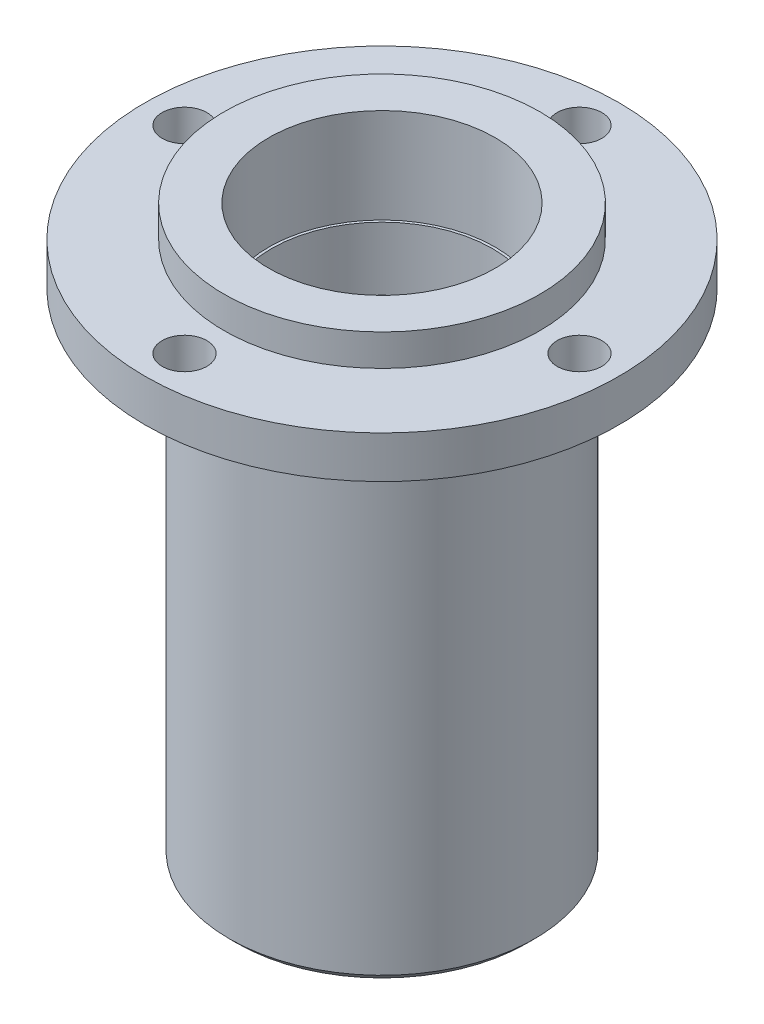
ISO-10303-21;
HEADER;
FILE_DESCRIPTION(('STEP AP214'),'2;1');
FILE_NAME('part.step','',(''),(''),'','','');
FILE_SCHEMA(('AUTOMOTIVE_DESIGN { 1 0 10303 214 1 1 1 1 }'));
ENDSEC;
DATA;
#1=APPLICATION_CONTEXT('core data for automotive mechanical design processes');
#2=APPLICATION_PROTOCOL_DEFINITION('international standard','automotive_design',2000,#1);
#3=PRODUCT_CONTEXT('',#1,'mechanical');
#4=PRODUCT('Part','Part','',(#3));
#5=PRODUCT_RELATED_PRODUCT_CATEGORY('part','',(#4));
#6=PRODUCT_DEFINITION_FORMATION('','',#4);
#7=PRODUCT_DEFINITION_CONTEXT('part definition',#1,'design');
#8=PRODUCT_DEFINITION('design','',#6,#7);
#9=PRODUCT_DEFINITION_SHAPE('','',#8);
#10=(LENGTH_UNIT() NAMED_UNIT(*) SI_UNIT(.MILLI.,.METRE.));
#11=(NAMED_UNIT(*) PLANE_ANGLE_UNIT() SI_UNIT($,.RADIAN.));
#12=(NAMED_UNIT(*) SI_UNIT($,.STERADIAN.) SOLID_ANGLE_UNIT());
#13=UNCERTAINTY_MEASURE_WITH_UNIT(LENGTH_MEASURE(1.E-05),#10,'distance_accuracy_value','');
#14=(GEOMETRIC_REPRESENTATION_CONTEXT(3) GLOBAL_UNCERTAINTY_ASSIGNED_CONTEXT((#13)) GLOBAL_UNIT_ASSIGNED_CONTEXT((#10,
#11,#12)) REPRESENTATION_CONTEXT('',''));
#15=CARTESIAN_POINT('',(0.,0.,0.));
#16=DIRECTION('',(0.,0.,1.));
#17=DIRECTION('',(1.,0.,0.));
#18=AXIS2_PLACEMENT_3D('',#15,#16,#17);
#19=CARTESIAN_POINT('',(0.,0.,0.));
#20=DIRECTION('',(0.,-1.,0.));
#21=DIRECTION('',(0.,0.,-1.));
#22=AXIS2_PLACEMENT_3D('',#19,#20,#21);
#23=CYLINDRICAL_SURFACE('',#22,29.);
#24=CARTESIAN_POINT('',(0.,1.50000000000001,0.));
#25=DIRECTION('',(0.,-1.,0.));
#26=DIRECTION('',(0.,0.,-1.));
#27=AXIS2_PLACEMENT_3D('',#24,#25,#26);
#28=CIRCLE('',#27,29.);
#29=CARTESIAN_POINT('',(0.,1.50000000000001,-29.));
#30=VERTEX_POINT('',#29);
#31=EDGE_CURVE('E10',#30,#30,#28,.F.);
#32=ORIENTED_EDGE('',*,*,#31,.T.);
#33=EDGE_LOOP('',(#32));
#34=FACE_BOUND('',#33,.T.);
#35=CARTESIAN_POINT('',(0.,94.,0.));
#36=DIRECTION('',(0.,-1.,0.));
#37=DIRECTION('',(0.,0.,-1.));
#38=AXIS2_PLACEMENT_3D('',#35,#36,#37);
#39=CIRCLE('',#38,29.);
#40=CARTESIAN_POINT('',(0.,94.,-29.));
#41=VERTEX_POINT('',#40);
#42=EDGE_CURVE('E44',#41,#41,#39,.T.);
#43=ORIENTED_EDGE('',*,*,#42,.T.);
#44=EDGE_LOOP('',(#43));
#45=FACE_BOUND('',#44,.T.);
#46=ADVANCED_FACE('F34',(#34,#45),#23,.T.);
#47=CARTESIAN_POINT('',(29.,94.,0.));
#48=DIRECTION('',(0.,-1.,0.));
#49=DIRECTION('',(0.,0.,-1.));
#50=AXIS2_PLACEMENT_3D('',#47,#48,#49);
#51=PLANE('',#50);
#52=CARTESIAN_POINT('',(37.5,94.,-3.89322431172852E-13));
#53=DIRECTION('',(0.,-1.,0.));
#54=DIRECTION('',(1.,0.,0.));
#55=AXIS2_PLACEMENT_3D('',#52,#53,#54);
#56=CIRCLE('',#55,4.25);
#57=CARTESIAN_POINT('',(41.75,94.,-4.33838844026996E-13));
#58=VERTEX_POINT('',#57);
#59=EDGE_CURVE('E108',#58,#58,#56,.F.);
#60=ORIENTED_EDGE('',*,*,#59,.T.);
#61=EDGE_LOOP('',(#60));
#62=FACE_BOUND('',#61,.T.);
#63=CARTESIAN_POINT('',(2.5839180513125E-13,94.,37.5));
#64=DIRECTION('',(0.,-1.,0.));
#65=DIRECTION('',(0.,0.,1.));
#66=AXIS2_PLACEMENT_3D('',#63,#64,#65);
#67=CIRCLE('',#66,4.25);
#68=CARTESIAN_POINT('',(2.8806941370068E-13,94.,41.75));
#69=VERTEX_POINT('',#68);
#70=EDGE_CURVE('E102',#69,#69,#67,.F.);
#71=ORIENTED_EDGE('',*,*,#70,.T.);
#72=EDGE_LOOP('',(#71));
#73=FACE_BOUND('',#72,.T.);
#74=CARTESIAN_POINT('',(-37.5,94.,1.27461179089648E-13));
#75=DIRECTION('',(0.,-1.,0.));
#76=DIRECTION('',(-1.,0.,0.));
#77=AXIS2_PLACEMENT_3D('',#74,#75,#76);
#78=CIRCLE('',#77,4.25);
#79=CARTESIAN_POINT('',(-41.75,94.,1.42299983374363E-13));
#80=VERTEX_POINT('',#79);
#81=EDGE_CURVE('E96',#80,#80,#78,.F.);
#82=ORIENTED_EDGE('',*,*,#81,.T.);
#83=EDGE_LOOP('',(#82));
#84=FACE_BOUND('',#83,.T.);
#85=CARTESIAN_POINT('',(0.,94.,-37.5));
#86=DIRECTION('',(0.,-1.,0.));
#87=DIRECTION('',(0.,0.,-1.));
#88=AXIS2_PLACEMENT_3D('',#85,#86,#87);
#89=CIRCLE('',#88,4.25);
#90=CARTESIAN_POINT('',(0.,94.,-41.75));
#91=VERTEX_POINT('',#90);
#92=EDGE_CURVE('E88',#91,#91,#89,.F.);
#93=ORIENTED_EDGE('',*,*,#92,.T.);
#94=EDGE_LOOP('',(#93));
#95=FACE_BOUND('',#94,.T.);
#96=CARTESIAN_POINT('',(0.,94.,0.));
#97=DIRECTION('',(0.,-1.,0.));
#98=DIRECTION('',(0.,0.,-1.));
#99=AXIS2_PLACEMENT_3D('',#96,#97,#98);
#100=CIRCLE('',#99,45.);
#101=CARTESIAN_POINT('',(0.,94.,-45.));
#102=VERTEX_POINT('',#101);
#103=EDGE_CURVE('E48',#102,#102,#100,.T.);
#104=ORIENTED_EDGE('',*,*,#103,.T.);
#105=EDGE_LOOP('',(#104));
#106=FACE_BOUND('',#105,.T.);
#107=ORIENTED_EDGE('',*,*,#42,.F.);
#108=EDGE_LOOP('',(#107));
#109=FACE_BOUND('',#108,.T.);
#110=ADVANCED_FACE('F112',(#62,#73,#84,#95,#106,#109),#51,.T.);
#111=CARTESIAN_POINT('',(0.,0.,0.));
#112=DIRECTION('',(0.,-1.,0.));
#113=DIRECTION('',(0.,0.,-1.));
#114=AXIS2_PLACEMENT_3D('',#111,#112,#113);
#115=CYLINDRICAL_SURFACE('',#114,45.);
#116=CARTESIAN_POINT('',(0.,102.,0.));
#117=DIRECTION('',(0.,-1.,0.));
#118=DIRECTION('',(0.,0.,-1.));
#119=AXIS2_PLACEMENT_3D('',#116,#117,#118);
#120=CIRCLE('',#119,45.);
#121=CARTESIAN_POINT('',(0.,102.,-45.));
#122=VERTEX_POINT('',#121);
#123=EDGE_CURVE('E54',#122,#122,#120,.T.);
#124=ORIENTED_EDGE('',*,*,#123,.T.);
#125=EDGE_LOOP('',(#124));
#126=FACE_BOUND('',#125,.T.);
#127=ORIENTED_EDGE('',*,*,#103,.F.);
#128=EDGE_LOOP('',(#127));
#129=FACE_BOUND('',#128,.T.);
#130=ADVANCED_FACE('F127',(#126,#129),#115,.T.);
#131=CARTESIAN_POINT('',(45.,102.,0.));
#132=DIRECTION('',(0.,1.,0.));
#133=DIRECTION('',(0.,0.,1.));
#134=AXIS2_PLACEMENT_3D('',#131,#132,#133);
#135=PLANE('',#134);
#136=CARTESIAN_POINT('',(37.5,102.,-3.89322431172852E-13));
#137=DIRECTION('',(0.,1.,0.));
#138=DIRECTION('',(-1.,0.,0.));
#139=AXIS2_PLACEMENT_3D('',#136,#137,#138);
#140=CIRCLE('',#139,4.25);
#141=CARTESIAN_POINT('',(33.25,102.,-3.44806018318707E-13));
#142=VERTEX_POINT('',#141);
#143=EDGE_CURVE('E105',#142,#142,#140,.T.);
#144=ORIENTED_EDGE('',*,*,#143,.F.);
#145=EDGE_LOOP('',(#144));
#146=FACE_BOUND('',#145,.T.);
#147=CARTESIAN_POINT('',(2.5839180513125E-13,102.,37.5));
#148=DIRECTION('',(0.,1.,0.));
#149=DIRECTION('',(0.,0.,-1.));
#150=AXIS2_PLACEMENT_3D('',#147,#148,#149);
#151=CIRCLE('',#150,4.25);
#152=CARTESIAN_POINT('',(2.2871419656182E-13,102.,33.25));
#153=VERTEX_POINT('',#152);
#154=EDGE_CURVE('E99',#153,#153,#151,.T.);
#155=ORIENTED_EDGE('',*,*,#154,.F.);
#156=EDGE_LOOP('',(#155));
#157=FACE_BOUND('',#156,.T.);
#158=CARTESIAN_POINT('',(-37.5,102.,1.27461179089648E-13));
#159=DIRECTION('',(0.,1.,0.));
#160=DIRECTION('',(1.,0.,0.));
#161=AXIS2_PLACEMENT_3D('',#158,#159,#160);
#162=CIRCLE('',#161,4.25);
#163=CARTESIAN_POINT('',(-33.25,102.,1.12622374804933E-13));
#164=VERTEX_POINT('',#163);
#165=EDGE_CURVE('E91',#164,#164,#162,.T.);
#166=ORIENTED_EDGE('',*,*,#165,.F.);
#167=EDGE_LOOP('',(#166));
#168=FACE_BOUND('',#167,.T.);
#169=CARTESIAN_POINT('',(0.,102.,-37.5));
#170=DIRECTION('',(0.,1.,0.));
#171=DIRECTION('',(0.,0.,1.));
#172=AXIS2_PLACEMENT_3D('',#169,#170,#171);
#173=CIRCLE('',#172,4.25);
#174=CARTESIAN_POINT('',(0.,102.,-33.25));
#175=VERTEX_POINT('',#174);
#176=EDGE_CURVE('E87',#175,#175,#173,.T.);
#177=ORIENTED_EDGE('',*,*,#176,.F.);
#178=EDGE_LOOP('',(#177));
#179=FACE_BOUND('',#178,.T.);
#180=CARTESIAN_POINT('',(0.,102.,0.));
#181=DIRECTION('',(0.,-1.,0.));
#182=DIRECTION('',(0.,0.,-1.));
#183=AXIS2_PLACEMENT_3D('',#180,#181,#182);
#184=CIRCLE('',#183,30.);
#185=CARTESIAN_POINT('',(0.,102.,-30.));
#186=VERTEX_POINT('',#185);
#187=EDGE_CURVE('E57',#186,#186,#184,.T.);
#188=ORIENTED_EDGE('',*,*,#187,.T.);
#189=EDGE_LOOP('',(#188));
#190=FACE_BOUND('',#189,.T.);
#191=ORIENTED_EDGE('',*,*,#123,.F.);
#192=EDGE_LOOP('',(#191));
#193=FACE_BOUND('',#192,.T.);
#194=ADVANCED_FACE('F123',(#146,#157,#168,#179,#190,#193),#135,.T.);
#195=CARTESIAN_POINT('',(0.,0.,0.));
#196=DIRECTION('',(0.,-1.,0.));
#197=DIRECTION('',(0.,0.,-1.));
#198=AXIS2_PLACEMENT_3D('',#195,#196,#197);
#199=CYLINDRICAL_SURFACE('',#198,30.);
#200=CARTESIAN_POINT('',(0.,108.,0.));
#201=DIRECTION('',(0.,-1.,0.));
#202=DIRECTION('',(0.,0.,-1.));
#203=AXIS2_PLACEMENT_3D('',#200,#201,#202);
#204=CIRCLE('',#203,30.);
#205=CARTESIAN_POINT('',(0.,108.,-30.));
#206=VERTEX_POINT('',#205);
#207=EDGE_CURVE('E60',#206,#206,#204,.T.);
#208=ORIENTED_EDGE('',*,*,#207,.T.);
#209=EDGE_LOOP('',(#208));
#210=FACE_BOUND('',#209,.T.);
#211=ORIENTED_EDGE('',*,*,#187,.F.);
#212=EDGE_LOOP('',(#211));
#213=FACE_BOUND('',#212,.T.);
#214=ADVANCED_FACE('F126',(#210,#213),#199,.T.);
#215=CARTESIAN_POINT('',(30.,108.,0.));
#216=DIRECTION('',(0.,1.,0.));
#217=DIRECTION('',(0.,0.,1.));
#218=AXIS2_PLACEMENT_3D('',#215,#216,#217);
#219=PLANE('',#218);
#220=CARTESIAN_POINT('',(0.,108.,0.));
#221=DIRECTION('',(0.,-1.,0.));
#222=DIRECTION('',(0.,0.,-1.));
#223=AXIS2_PLACEMENT_3D('',#220,#221,#222);
#224=CIRCLE('',#223,21.5);
#225=CARTESIAN_POINT('',(0.,108.,-21.5));
#226=VERTEX_POINT('',#225);
#227=EDGE_CURVE('E63',#226,#226,#224,.T.);
#228=ORIENTED_EDGE('',*,*,#227,.T.);
#229=EDGE_LOOP('',(#228));
#230=FACE_BOUND('',#229,.T.);
#231=ORIENTED_EDGE('',*,*,#207,.F.);
#232=EDGE_LOOP('',(#231));
#233=FACE_BOUND('',#232,.T.);
#234=ADVANCED_FACE('F174',(#230,#233),#219,.T.);
#235=CARTESIAN_POINT('',(0.,0.,0.));
#236=DIRECTION('',(0.,-1.,0.));
#237=DIRECTION('',(0.,0.,-1.));
#238=AXIS2_PLACEMENT_3D('',#235,#236,#237);
#239=CYLINDRICAL_SURFACE('',#238,21.5);
#240=CARTESIAN_POINT('',(0.,90.,0.));
#241=DIRECTION('',(0.,-1.,0.));
#242=DIRECTION('',(0.,0.,-1.));
#243=AXIS2_PLACEMENT_3D('',#240,#241,#242);
#244=CIRCLE('',#243,21.5);
#245=CARTESIAN_POINT('',(0.,90.,-21.5));
#246=VERTEX_POINT('',#245);
#247=EDGE_CURVE('E66',#246,#246,#244,.T.);
#248=ORIENTED_EDGE('',*,*,#247,.T.);
#249=EDGE_LOOP('',(#248));
#250=FACE_BOUND('',#249,.T.);
#251=ORIENTED_EDGE('',*,*,#227,.F.);
#252=EDGE_LOOP('',(#251));
#253=FACE_BOUND('',#252,.T.);
#254=ADVANCED_FACE('F181',(#250,#253),#239,.F.);
#255=CARTESIAN_POINT('',(21.5,90.,0.));
#256=DIRECTION('',(0.,1.,0.));
#257=DIRECTION('',(0.,0.,1.));
#258=AXIS2_PLACEMENT_3D('',#255,#256,#257);
#259=PLANE('',#258);
#260=CARTESIAN_POINT('',(0.,90.,0.));
#261=DIRECTION('',(0.,-1.,0.));
#262=DIRECTION('',(0.,0.,-1.));
#263=AXIS2_PLACEMENT_3D('',#260,#261,#262);
#264=CIRCLE('',#263,21.);
#265=CARTESIAN_POINT('',(0.,90.,-21.));
#266=VERTEX_POINT('',#265);
#267=EDGE_CURVE('E69',#266,#266,#264,.T.);
#268=ORIENTED_EDGE('',*,*,#267,.T.);
#269=EDGE_LOOP('',(#268));
#270=FACE_BOUND('',#269,.T.);
#271=ORIENTED_EDGE('',*,*,#247,.F.);
#272=EDGE_LOOP('',(#271));
#273=FACE_BOUND('',#272,.T.);
#274=ADVANCED_FACE('F189',(#270,#273),#259,.T.);
#275=CARTESIAN_POINT('',(0.,0.,0.));
#276=DIRECTION('',(0.,-1.,0.));
#277=DIRECTION('',(0.,0.,-1.));
#278=AXIS2_PLACEMENT_3D('',#275,#276,#277);
#279=CYLINDRICAL_SURFACE('',#278,21.);
#280=CARTESIAN_POINT('',(0.,78.,0.));
#281=DIRECTION('',(0.,-1.,0.));
#282=DIRECTION('',(0.,0.,-1.));
#283=AXIS2_PLACEMENT_3D('',#280,#281,#282);
#284=CIRCLE('',#283,21.);
#285=CARTESIAN_POINT('',(0.,78.,-21.));
#286=VERTEX_POINT('',#285);
#287=EDGE_CURVE('E72',#286,#286,#284,.T.);
#288=ORIENTED_EDGE('',*,*,#287,.T.);
#289=EDGE_LOOP('',(#288));
#290=FACE_BOUND('',#289,.T.);
#291=ORIENTED_EDGE('',*,*,#267,.F.);
#292=EDGE_LOOP('',(#291));
#293=FACE_BOUND('',#292,.T.);
#294=ADVANCED_FACE('F197',(#290,#293),#279,.F.);
#295=CARTESIAN_POINT('',(21.,78.,0.));
#296=DIRECTION('',(0.,1.,0.));
#297=DIRECTION('',(0.,0.,1.));
#298=AXIS2_PLACEMENT_3D('',#295,#296,#297);
#299=PLANE('',#298);
#300=CARTESIAN_POINT('',(0.,78.,0.));
#301=DIRECTION('',(0.,-1.,0.));
#302=DIRECTION('',(0.,0.,-1.));
#303=AXIS2_PLACEMENT_3D('',#300,#301,#302);
#304=CIRCLE('',#303,19.);
#305=CARTESIAN_POINT('',(0.,78.,-19.));
#306=VERTEX_POINT('',#305);
#307=EDGE_CURVE('E75',#306,#306,#304,.T.);
#308=ORIENTED_EDGE('',*,*,#307,.T.);
#309=EDGE_LOOP('',(#308));
#310=FACE_BOUND('',#309,.T.);
#311=ORIENTED_EDGE('',*,*,#287,.F.);
#312=EDGE_LOOP('',(#311));
#313=FACE_BOUND('',#312,.T.);
#314=ADVANCED_FACE('F205',(#310,#313),#299,.T.);
#315=CARTESIAN_POINT('',(0.,0.,0.));
#316=DIRECTION('',(0.,-1.,0.));
#317=DIRECTION('',(0.,0.,-1.));
#318=AXIS2_PLACEMENT_3D('',#315,#316,#317);
#319=CYLINDRICAL_SURFACE('',#318,19.);
#320=CARTESIAN_POINT('',(0.,12.,0.));
#321=DIRECTION('',(0.,-1.,0.));
#322=DIRECTION('',(0.,0.,-1.));
#323=AXIS2_PLACEMENT_3D('',#320,#321,#322);
#324=CIRCLE('',#323,19.);
#325=CARTESIAN_POINT('',(0.,12.,-19.));
#326=VERTEX_POINT('',#325);
#327=EDGE_CURVE('E78',#326,#326,#324,.T.);
#328=ORIENTED_EDGE('',*,*,#327,.T.);
#329=EDGE_LOOP('',(#328));
#330=FACE_BOUND('',#329,.T.);
#331=ORIENTED_EDGE('',*,*,#307,.F.);
#332=EDGE_LOOP('',(#331));
#333=FACE_BOUND('',#332,.T.);
#334=ADVANCED_FACE('F213',(#330,#333),#319,.F.);
#335=CARTESIAN_POINT('',(19.,12.,0.));
#336=DIRECTION('',(0.,-1.,0.));
#337=DIRECTION('',(0.,0.,-1.));
#338=AXIS2_PLACEMENT_3D('',#335,#336,#337);
#339=PLANE('',#338);
#340=CARTESIAN_POINT('',(0.,12.,0.));
#341=DIRECTION('',(0.,-1.,0.));
#342=DIRECTION('',(0.,0.,-1.));
#343=AXIS2_PLACEMENT_3D('',#340,#341,#342);
#344=CIRCLE('',#343,21.);
#345=CARTESIAN_POINT('',(0.,12.,-21.));
#346=VERTEX_POINT('',#345);
#347=EDGE_CURVE('E81',#346,#346,#344,.T.);
#348=ORIENTED_EDGE('',*,*,#347,.T.);
#349=EDGE_LOOP('',(#348));
#350=FACE_BOUND('',#349,.T.);
#351=ORIENTED_EDGE('',*,*,#327,.F.);
#352=EDGE_LOOP('',(#351));
#353=FACE_BOUND('',#352,.T.);
#354=ADVANCED_FACE('F222',(#350,#353),#339,.T.);
#355=CARTESIAN_POINT('',(0.,0.,0.));
#356=DIRECTION('',(0.,-1.,0.));
#357=DIRECTION('',(0.,0.,-1.));
#358=AXIS2_PLACEMENT_3D('',#355,#356,#357);
#359=CYLINDRICAL_SURFACE('',#358,21.);
#360=CARTESIAN_POINT('',(0.,0.,0.));
#361=DIRECTION('',(0.,-1.,0.));
#362=DIRECTION('',(0.,0.,-1.));
#363=AXIS2_PLACEMENT_3D('',#360,#361,#362);
#364=CIRCLE('',#363,21.);
#365=CARTESIAN_POINT('',(0.,0.,-21.));
#366=VERTEX_POINT('',#365);
#367=EDGE_CURVE('E84',#366,#366,#364,.T.);
#368=ORIENTED_EDGE('',*,*,#367,.T.);
#369=EDGE_LOOP('',(#368));
#370=FACE_BOUND('',#369,.T.);
#371=ORIENTED_EDGE('',*,*,#347,.F.);
#372=EDGE_LOOP('',(#371));
#373=FACE_BOUND('',#372,.T.);
#374=ADVANCED_FACE('F230',(#370,#373),#359,.F.);
#375=CARTESIAN_POINT('',(21.,0.,0.));
#376=DIRECTION('',(0.,-1.,0.));
#377=DIRECTION('',(0.,0.,-1.));
#378=AXIS2_PLACEMENT_3D('',#375,#376,#377);
#379=PLANE('',#378);
#380=CARTESIAN_POINT('',(0.,0.,0.));
#381=DIRECTION('',(0.,-1.,0.));
#382=DIRECTION('',(0.,0.,-1.));
#383=AXIS2_PLACEMENT_3D('',#380,#381,#382);
#384=CIRCLE('',#383,27.5);
#385=CARTESIAN_POINT('',(0.,0.,-27.5));
#386=VERTEX_POINT('',#385);
#387=EDGE_CURVE('E40',#386,#386,#384,.T.);
#388=ORIENTED_EDGE('',*,*,#387,.T.);
#389=EDGE_LOOP('',(#388));
#390=FACE_BOUND('',#389,.T.);
#391=ORIENTED_EDGE('',*,*,#367,.F.);
#392=EDGE_LOOP('',(#391));
#393=FACE_BOUND('',#392,.T.);
#394=ADVANCED_FACE('F238',(#390,#393),#379,.T.);
#395=CARTESIAN_POINT('',(0.,-0.001000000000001,-37.5));
#396=DIRECTION('',(0.,1.,0.));
#397=DIRECTION('',(0.,0.,1.));
#398=AXIS2_PLACEMENT_3D('',#395,#396,#397);
#399=CYLINDRICAL_SURFACE('',#398,4.25);
#400=ORIENTED_EDGE('',*,*,#92,.F.);
#401=EDGE_LOOP('',(#400));
#402=FACE_BOUND('',#401,.T.);
#403=ORIENTED_EDGE('',*,*,#176,.T.);
#404=EDGE_LOOP('',(#403));
#405=FACE_BOUND('',#404,.T.);
#406=ADVANCED_FACE('F245',(#402,#405),#399,.F.);
#407=CARTESIAN_POINT('',(-37.5,-0.001000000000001,1.27461179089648E-13));
#408=DIRECTION('',(0.,1.,0.));
#409=DIRECTION('',(1.,0.,0.));
#410=AXIS2_PLACEMENT_3D('',#407,#408,#409);
#411=CYLINDRICAL_SURFACE('',#410,4.25);
#412=ORIENTED_EDGE('',*,*,#81,.F.);
#413=EDGE_LOOP('',(#412));
#414=FACE_BOUND('',#413,.T.);
#415=ORIENTED_EDGE('',*,*,#165,.T.);
#416=EDGE_LOOP('',(#415));
#417=FACE_BOUND('',#416,.T.);
#418=ADVANCED_FACE('F250',(#414,#417),#411,.F.);
#419=CARTESIAN_POINT('',(2.5839180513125E-13,-0.001000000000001,37.5));
#420=DIRECTION('',(0.,1.,0.));
#421=DIRECTION('',(0.,0.,-1.));
#422=AXIS2_PLACEMENT_3D('',#419,#420,#421);
#423=CYLINDRICAL_SURFACE('',#422,4.25);
#424=ORIENTED_EDGE('',*,*,#70,.F.);
#425=EDGE_LOOP('',(#424));
#426=FACE_BOUND('',#425,.T.);
#427=ORIENTED_EDGE('',*,*,#154,.T.);
#428=EDGE_LOOP('',(#427));
#429=FACE_BOUND('',#428,.T.);
#430=ADVANCED_FACE('F119',(#426,#429),#423,.F.);
#431=CARTESIAN_POINT('',(37.5,-0.001000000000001,-3.89322431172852E-13));
#432=DIRECTION('',(0.,1.,0.));
#433=DIRECTION('',(-1.,0.,0.));
#434=AXIS2_PLACEMENT_3D('',#431,#432,#433);
#435=CYLINDRICAL_SURFACE('',#434,4.25);
#436=ORIENTED_EDGE('',*,*,#59,.F.);
#437=EDGE_LOOP('',(#436));
#438=FACE_BOUND('',#437,.T.);
#439=ORIENTED_EDGE('',*,*,#143,.T.);
#440=EDGE_LOOP('',(#439));
#441=FACE_BOUND('',#440,.T.);
#442=ADVANCED_FACE('F115',(#438,#441),#435,.F.);
#443=CARTESIAN_POINT('',(0.,0.,0.));
#444=DIRECTION('',(0.,1.,0.));
#445=DIRECTION('',(0.,0.,1.));
#446=AXIS2_PLACEMENT_3D('',#443,#444,#445);
#447=CONICAL_SURFACE('',#446,27.5,0.785398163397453);
#448=ORIENTED_EDGE('',*,*,#31,.F.);
#449=EDGE_LOOP('',(#448));
#450=FACE_BOUND('',#449,.T.);
#451=ORIENTED_EDGE('',*,*,#387,.F.);
#452=EDGE_LOOP('',(#451));
#453=FACE_BOUND('',#452,.T.);
#454=ADVANCED_FACE('F118',(#450,#453),#447,.T.);
#455=CLOSED_SHELL('',(#46,#110,#130,#194,#214,#234,#254,#274,#294,#314,#334,#354,#374,#394,#406,
#418,#430,#442,#454));
#456=MANIFOLD_SOLID_BREP('B2',#455);
#457=ADVANCED_BREP_SHAPE_REPRESENTATION('',(#18,#456),#14);
#458=SHAPE_DEFINITION_REPRESENTATION(#9,#457);
ENDSEC;
END-ISO-10303-21;
